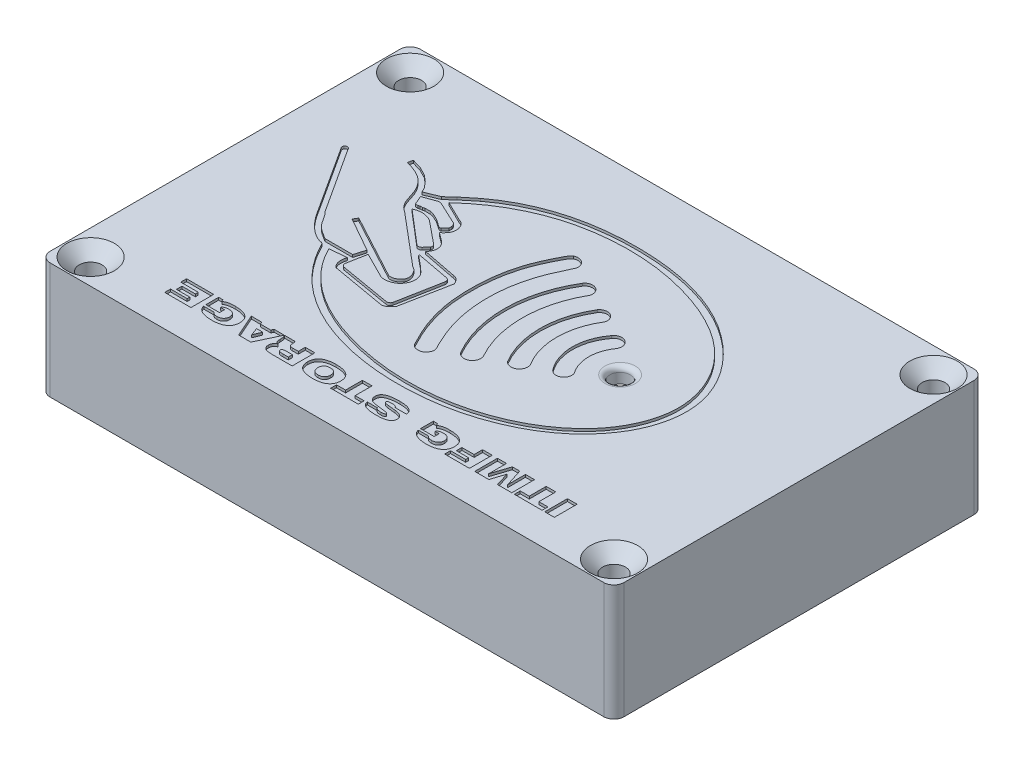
from build123d import *

# Parameters (mm, degrees)
EXTRUDE_BASE_DEPTH                     = 20
EXTRUDE_LID_DEPTH                      = 3
CUT_LED_HOLE_DEPTH                     = 3
CUT_LED_HOLE_DEPTH_BACK                = 5
LED_HOLE_R                             = 2
SMOOTH_LED_HOLE_R                      = 1
CUT_LOGO_DEPTH                         = 0.5
TEXT_2_W                               = 1.903846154
TEXT_2_H                               = 4.5
CUT_EXTRUDE1_DEPTH                     = 0.5
CUT_THE_SCREW_HOLES_NICELY_D           = 4.5
CUT_THE_SCREW_HOLES_NICELY_CSINK_D     = 9.4
CUT_THE_SCREW_HOLES_NICELY_CSINK_ANGLE = 90


with BuildPart() as part:
    # Base Outline → Extrude Base (new body)
    with BuildSketch(Plane(origin=(0, 0, 0), x_dir=(1, 0, 0), z_dir=(0, 1, 0))):
        with BuildLine():
            Line((-54.812393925, -36.63058605), (54.698066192, -36.63058605))
            ThreePointArc((54.698066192, -36.63058605), (56.112279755, -36.044799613), (56.698066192, -34.63058605))
            Line((56.698066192, -34.63058605), (56.698066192, 34.575855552))
            ThreePointArc((56.698066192, 34.575855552), (56.112279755, 35.990069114), (54.698066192, 36.575855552))
            Line((54.698066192, 36.575855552), (-54.812393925, 36.575855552))
            ThreePointArc((-54.812393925, 36.575855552), (-56.226607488, 35.990069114), (-56.812393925, 34.575855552))
            Line((-56.812393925, 34.575855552), (-56.812393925, -34.63058605))
            ThreePointArc((-56.812393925, -34.63058605), (-56.226607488, -36.044799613), (-54.812393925, -36.63058605))
        make_face()
        with BuildLine():
            Line((-44.812393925, -26.63058605), (44.727963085, -26.63058605))
            ThreePointArc((44.727963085, -26.63058605), (46.142176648, -26.044799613), (46.727963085, -24.63058605))
            Line((46.727963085, -24.63058605), (46.727963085, 24.575855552))
            ThreePointArc((46.727963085, 24.575855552), (46.142176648, 25.990069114), (44.727963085, 26.575855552))
            Line((44.727963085, 26.575855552), (-44.812393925, 26.575855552))
            ThreePointArc((-44.812393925, 26.575855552), (-46.226607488, 25.990069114), (-46.812393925, 24.575855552))
            Line((-46.812393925, 24.575855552), (-46.812393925, -24.63058605))
            ThreePointArc((-46.812393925, -24.63058605), (-46.226607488, -26.044799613), (-44.812393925, -26.63058605))
        make_face(mode=Mode.SUBTRACT)
    extrude(amount=EXTRUDE_BASE_DEPTH)

    # Lid Outline → Extrude Lid (add)
    with BuildSketch(Plane(origin=(0, 20, 0), x_dir=(1, 0, 0), z_dir=(0, 1, 0))):
        with BuildLine():
            Line((-54.812393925, 36.575855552), (54.698066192, 36.575855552))
            ThreePointArc((54.698066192, 36.575855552), (56.112279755, 35.990069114), (56.698066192, 34.575855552))
            Line((56.698066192, 34.575855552), (56.698066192, -34.63058605))
            ThreePointArc((56.698066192, -34.63058605), (56.112279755, -36.044799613), (54.698066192, -36.63058605))
            Line((54.698066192, -36.63058605), (-54.812393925, -36.63058605))
            ThreePointArc((-54.812393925, -36.63058605), (-56.226607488, -36.044799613), (-56.812393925, -34.63058605))
            Line((-56.812393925, -34.63058605), (-56.812393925, 34.575855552))
            ThreePointArc((-56.812393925, 34.575855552), (-56.226607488, 35.990069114), (-54.812393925, 36.575855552))
        make_face()
    extrude(amount=EXTRUDE_LID_DEPTH)

    # LED Hole → Cut LED Hole (cut, two sides: drawn at the far end of the back side and taken through both)
    with BuildSketch(Plane.XZ.offset(-20).offset(-CUT_LED_HOLE_DEPTH_BACK)):
        with Locations(Location((20.727963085, -0.57585555, 0), (0, 0, 90))):
            Circle(LED_HOLE_R)
    extrude(amount=CUT_LED_HOLE_DEPTH + CUT_LED_HOLE_DEPTH_BACK, mode=Mode.SUBTRACT)

    # Smooth LED Hole
    smooth_led_hole_edges = [part.edges().sort_by_distance(p)[0] for p in [
        (20.727963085, 23, -2.57585555),
    ]]
    fillet(smooth_led_hole_edges, radius=SMOOTH_LED_HOLE_R)

    # RDIF Logo → Cut logo (cut)
    # profile 1 of 5: a face of its own
    with BuildSketch(Plane(origin=(0, 23, 0), x_dir=(1, 0, 0), z_dir=(0, 1, 0))):
        with BuildLine():
            Line((-36.453230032, 16.864000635), (-34.55383018, 16.300568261))
            Line((-34.55383018, 16.300568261), (-32.880662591, 15.44980508))
            Line((-32.880662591, 15.44980508), (-31.60451782, 14.372171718))
            Line((-31.60451782, 14.372171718), (-30.583602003, 13.12438572))
            Line((-30.583602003, 13.12438572), (-30.186579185, 12.301981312))
            Line((-30.186579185, 12.301981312), (-27.435778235, 13.436332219))
            Line((-27.435778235, 13.436332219), (-25.832494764, 14.910988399))
            Line((-25.832494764, 14.910988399), (-23.278074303, 17.000968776))
            add(Edge.make_bspline(
                [(-23.278074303, 17.000968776), (-16.047440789, 22.482347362), (0.265225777, 25.862315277), (22.80013356, 20.949843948), (34.323290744, 7.09897488), (33.293264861, -5.28073079), (27.301593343, -14.707004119), (14.921661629, -21.590516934), (-7.111487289, -24.816101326), (-25.390652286, -18.14910844), (-31.110912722, -6.646615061)],
                knots=[0, 0, 0, 0, 0.175847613, 0.320221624, 0.444344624, 0.487297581, 0.560216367, 0.656670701, 0.759438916, 1, 1, 1, 1], degree=3))
            add(Edge.make_bspline(
                [(-31.110912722, -6.646615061), (-31.318039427, -6.195488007), (-31.810513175, -6.259735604)],
                knots=[0, 0, 0, 1, 1, 1], degree=2))
            add(Edge.make_bspline(
                [(-31.810513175, -6.259735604), (-34.299918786, -5.397679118), (-36.117283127, -3.117275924), (-37.431458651, -0.954942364)],
                knots=[0, 0, 0, 0, 1, 1, 1, 1], degree=3))
            Line((-37.431458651, -0.954942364), (-45.669838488, 11.766909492))
            ThreePointArc((-45.669838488, 11.766909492), (-45.610257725, 12.607259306), (-44.825055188, 12.301981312))
            Line((-44.825055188, 12.301981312), (-36.453230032, -0.589827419))
            add(Edge.make_bspline(
                [(-36.453230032, -0.589827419), (-35.536889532, -1.444721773), (-34.701822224, -3.718891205), (-32.595818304, -4.743055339), (-31.810513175, -5.2804215)],
                knots=[0, 0, 0, 0, 0.566610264, 1, 1, 1, 1], degree=3))
            Line((-31.810513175, -5.2804215), (-26.3173643, -5.2804215))
            Line((-26.3173643, -5.2804215), (-25.669741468, -3.097205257))
            Line((-25.669741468, -3.097205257), (-32.450573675, 0.740477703))
            Line((-32.450573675, 0.740477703), (-31.974932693, 1.580891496))
            Line((-31.974932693, 1.580891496), (-19.219743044, -5.2804215))
            add(Edge.make_bspline(
                [(-19.219743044, -5.2804215), (-18.696820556, -5.461714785), (-17.784528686, -5.196225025), (-16.212112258, -3.660119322), (-17.459848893, -1.717148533), (-18.303539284, -1.408783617)],
                knots=[0, 0, 0, 0, 0.25554422, 0.468479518, 1, 1, 1, 1], degree=3))
            Line((-18.303539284, -1.408783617), (-28.528373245, 7.203531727))
            add(Edge.make_bspline(
                [(-36.702261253, 15.897255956), (-35.45959387, 15.572830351), (-33.066201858, 14.814458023), (-30.435041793, 11.287723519), (-30.365637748, 8.296754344), (-28.528373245, 7.203531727)],
                knots=[0, 0, 0, 0, 0.313403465, 0.576875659, 1, 1, 1, 1], degree=3))
            Line((-36.702261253, 15.897255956), (-36.453230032, 16.864000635))
        make_face()
        with BuildLine():
            Line((-29.650954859, -6.646615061), (-26.3173643, -6.324600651))
            add(Edge.make_bspline(
                [(-26.3173643, -6.324600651), (-26.628454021, -7.293227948), (-26.627540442, -8.488166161), (-25.669741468, -9.184966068)],
                knots=[0, 0, 0, 0, 1, 1, 1, 1], degree=3))
            Line((-25.669741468, -9.184966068), (-14.911665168, -11.068003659))
            add(Edge.make_bspline(
                [(-13.093136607, -9.773851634), (-13.542803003, -10.382088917), (-14.028171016, -11.05452876), (-14.911665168, -11.068003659)],
                knots=[0, 0, 0, 0, 1, 1, 1, 1], degree=3))
            Line((-13.093136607, -9.773851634), (-11.249053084, -0.261514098))
            add(Edge.make_bspline(
                [(-12.833707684, 1.137104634), (-12.054831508, 1.107840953), (-11.483194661, 0.42025389), (-11.249053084, -0.261514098)],
                knots=[0, 0, 0, 0, 1, 1, 1, 1], degree=3))
            Line((-12.833707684, 1.137104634), (-19.632398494, 2.464071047))
            add(Edge.make_bspline(
                [(-19.890380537, 5.845916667), (-19.413492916, 5.520192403), (-18.597391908, 4.338016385), (-19.134772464, 2.957861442), (-19.632398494, 2.464071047)],
                knots=[0, 0, 0, 0, 0.454204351, 1, 1, 1, 1], degree=3))
            Line((-19.890380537, 5.845916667), (-21.495914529, 7.05147954))
            add(Edge.make_bspline(
                [(-21.733873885, 11.209896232), (-20.978357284, 11.039809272), (-20.265799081, 10.080918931), (-20.192567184, 8.281794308), (-20.992320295, 7.451772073), (-21.495914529, 7.05147954)],
                knots=[0, 0, 0, 0, 0.422833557, 0.606809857, 1, 1, 1, 1], degree=3))
            Line((-21.733873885, 11.209896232), (-25.669741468, 13.12438572))
            add(Edge.make_bspline(
                [(-25.669741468, 13.12438572), (-22.024273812, 16.539992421), (-14.649369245, 20.937554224), (-1.356383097, 23.4439105), (13.610395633, 21.982734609), (28.39074434, 14.520341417), (33.477301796, 0.79455332), (29.782257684, -9.377896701), (20.256060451, -17.98866387), (6.503882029, -22.227968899), (-12.734108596, -20.998017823), (-25.762831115, -14.697153), (-29.650954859, -6.646615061)],
                knots=[0, 0, 0, 0, 0.101435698, 0.16877412, 0.271066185, 0.404844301, 0.476585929, 0.547212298, 0.609656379, 0.732259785, 0.825504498, 1, 1, 1, 1], degree=3))
        make_face(mode=Mode.SUBTRACT)
        Polygon((-29.548876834, 11.373389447), (-26.952651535, 12.301981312), (-26.470717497, 12.301981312), (-21.817966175, 10.114142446), (-21.495914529, 9.818763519), (-21.33391542, 9.365834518), (-21.33391542, 8.823802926), (-21.733873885, 8.387728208), (-22.13153491, 7.954158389), (-22.475328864, 7.954158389), (-24.144341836, 9.094818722), (-25.301566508, 9.638974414), (-26.064479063, 9.818763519), (-27.139206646, 9.818763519), (-27.484485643, 9.695267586), (-27.947612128, 9.695267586), (-28.250764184, 9.586839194), (-28.787110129, 9.586839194), align=None, mode=Mode.SUBTRACT)
        with BuildLine():
            Line((-28.250764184, 8.387728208), (-21.733873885, 2.833436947))
            ThreePointArc((-21.733873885, 2.833436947), (-21.217144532, 2.617011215), (-20.700415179, 2.833436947))
            Line((-20.700415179, 2.833436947), (-19.890380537, 3.73333579))
            ThreePointArc((-19.890380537, 3.73333579), (-19.918888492, 4.275334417), (-20.29344305, 4.668124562))
            Line((-20.29344305, 4.668124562), (-24.545489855, 8.131452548))
            add(Edge.make_bspline(
                [(-28.250764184, 8.387728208), (-27.108478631, 9.009359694), (-25.610444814, 8.846516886), (-24.545489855, 8.131452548)],
                knots=[0, 0, 0, 0, 1, 1, 1, 1], degree=3))
        make_face(mode=Mode.SUBTRACT)
        with BuildLine():
            Line((-19.667047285, 1.268303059), (-13.067469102, 0.022295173))
            ThreePointArc((-13.067469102, 0.022295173), (-12.61912421, -0.271000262), (-12.509487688, -0.795419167))
            Line((-12.509487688, -0.795419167), (-14.143639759, -9.450833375))
            ThreePointArc((-14.143639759, -9.450833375), (-14.431779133, -9.895626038), (-14.94902882, -10.011027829))
            Line((-14.94902882, -10.011027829), (-24.967224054, -8.304583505))
            ThreePointArc((-24.967224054, -8.304583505), (-25.424341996, -8.014231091), (-25.537530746, -7.484656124))
            Line((-25.537530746, -7.484656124), (-24.823761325, -3.704120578))
            Line((-24.823761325, -3.704120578), (-19.632398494, -6.324600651))
            add(Edge.make_bspline(
                [(-19.667047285, 1.268303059), (-19.704123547, 1.119193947), (-19.510541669, 0.991178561), (-19.16416982, 0.696089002), (-18.413582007, 0.107241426), (-17.280987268, -0.852305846), (-16.029381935, -1.983083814), (-15.592813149, -3.80275197), (-16.617653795, -6.065741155), (-18.638252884, -6.562819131), (-19.632398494, -6.324600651)],
                knots=[0, 0, 0, 0, 0.033060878, 0.052211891, 0.119094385, 0.274788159, 0.438452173, 0.533718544, 0.737249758, 1, 1, 1, 1], degree=3))
        make_face(mode=Mode.SUBTRACT)
    # profile 2 of 5: a face of its own
    with BuildSketch(Plane(origin=(0, 23, 0), x_dir=(1, 0, 0), z_dir=(0, 1, 0))):
        with BuildLine():
            ThreePointArc((-4.225157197, 16.300568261), (-2.522120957, 16.166954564), (-1.863395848, 14.590799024))
            add(Edge.make_bspline(
                [(-4.225157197, 16.300568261), (-4.641296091, 15.979485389), (-5.048363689, 15.304453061), (-5.951083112, 13.517917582), (-7.359487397, 10.548943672), (-8.534285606, 6.119180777), (-8.958858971, 0.79391961), (-8.660034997, -4.736358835), (-7.123587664, -9.958269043), (-5.549730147, -13.151813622), (-4.633979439, -14.897213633), (-3.736258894, -15.240641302), (-2.446429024, -15.150807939), (-1.741979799, -13.950104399), (-1.930421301, -13.075203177), (-2.258063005, -12.56570705), (-2.720081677, -11.575454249), (-3.60908864, -9.619618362), (-4.991102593, -5.840609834), (-6.06249277, 1.44818103), (-4.969260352, 7.678861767), (-3.225391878, 11.598934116), (-2.716841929, 12.727380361), (-2.177041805, 13.813300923), (-1.863395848, 14.590799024)],
                knots=[0, 0, 0, 0, 0.023455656, 0.035575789, 0.091466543, 0.17305309, 0.242956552, 0.33462833, 0.424685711, 0.487210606, 0.500729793, 0.510695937, 0.52922901, 0.555717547, 0.559790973, 0.569747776, 0.582937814, 0.609770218, 0.667724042, 0.765952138, 0.943514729, 0.944708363, 0.961751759, 1, 1, 1, 1], degree=3))
        make_face()
    # profile 3 of 5: a face of its own
    with BuildSketch(Plane(origin=(0, 23, 0), x_dir=(1, 0, 0), z_dir=(0, 1, 0))):
        with BuildLine():
            ThreePointArc((1.335958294, 12.565783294), (3.307638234, 13.076763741), (4.12219577, 11.209916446))
            ThreePointArc((4.12219577, 11.209916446), (1.303411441, 0.811966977), (3.950883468, -9.630915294))
            ThreePointArc((3.950883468, -9.630915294), (3.316807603, -11.868715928), (1.073401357, -11.254767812))
            ThreePointArc((1.073401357, -11.254767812), (-2.051769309, 0.691401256), (1.335958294, 12.565783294))
        make_face()
    # profile 4 of 5: a face of its own
    with BuildSketch(Plane(origin=(0, 23, 0), x_dir=(1, 0, 0), z_dir=(0, 1, 0))):
        with BuildLine():
            ThreePointArc((7.323215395, 9.460258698), (9.300679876, 9.992136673), (10.155732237, 8.131452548))
            ThreePointArc((10.155732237, 8.131452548), (8.015463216, 0.742418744), (10.155732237, -6.646615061))
            ThreePointArc((10.155732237, -6.646615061), (9.445606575, -8.662978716), (7.338107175, -8.304583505))
            ThreePointArc((7.338107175, -8.304583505), (4.859518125, 0.575766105), (7.323215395, 9.460258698))
        make_face()
    # profile 5 of 5: a face of its own
    with BuildSketch(Plane(origin=(0, 23, 0), x_dir=(1, 0, 0), z_dir=(0, 1, 0))):
        with BuildLine():
            ThreePointArc((13.16591922, 6.435321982), (15.339589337, 6.898902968), (15.89447955, 4.746730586))
            ThreePointArc((15.89447955, 4.746730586), (14.537367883, 0.555986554), (15.89447955, -3.634757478))
            ThreePointArc((15.89447955, -3.634757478), (15.335271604, -5.604386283), (13.306247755, -5.33013571))
            ThreePointArc((13.306247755, -5.33013571), (11.208633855, 0.528411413), (13.16591922, 6.435321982))
        make_face()
    extrude(amount=-CUT_LOGO_DEPTH, mode=Mode.SUBTRACT)

    # Text 2 → Cut-Extrude1 (cut)
    # profile 1 of 12: a face of its own
    with BuildSketch(Plane(origin=(0, 23, 0), x_dir=(1, 0, 0), z_dir=(0, 1, 0))):
        with Locations((37.694925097, -28.105742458)):
            Rectangle(TEXT_2_W, TEXT_2_H)
    # profile 2 of 12: a face of its own
    with BuildSketch(Plane(origin=(0, 23, 0), x_dir=(1, 0, 0), z_dir=(0, 1, 0))):
        Polygon((34.435309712, -25.855742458), (34.435309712, -29.201896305), (36.223771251, -29.201896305), (36.223771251, -30.355742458), (30.74300202, -30.355742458), (30.74300202, -29.201896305), (32.531463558, -29.201896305), (32.531463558, -25.855742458), align=None)
    # profile 3 of 12: a face of its own
    with BuildSketch(Plane(origin=(0, 23, 0), x_dir=(1, 0, 0), z_dir=(0, 1, 0))):
        Polygon((30.223771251, -25.855742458), (30.223771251, -30.355742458), (27.388735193, -30.355742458), (26.572028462, -27.614456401), (25.688615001, -30.355742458), (22.896848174, -30.355742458), (22.896848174, -25.855742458), (24.685309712, -25.855742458), (24.685309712, -29.369564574), (25.836451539, -25.855742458), (27.29768952, -25.855742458), (28.435309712, -29.369564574), (28.435309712, -25.855742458), align=None)
    # profile 4 of 12: a face of its own
    with BuildSketch(Plane(origin=(0, 23, 0), x_dir=(1, 0, 0), z_dir=(0, 1, 0))):
        Polygon((21.858386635, -25.855742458), (21.858386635, -30.355742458), (16.954540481, -30.355742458), (16.954540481, -29.201896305), (19.954540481, -29.201896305), (19.954540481, -28.624973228), (17.531463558, -28.624973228), (17.531463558, -27.528819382), (19.954540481, -27.528819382), (19.954540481, -25.855742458), align=None)
    # profile 5 of 12: a face of its own
    with BuildSketch(Plane(origin=(0, 23, 0), x_dir=(1, 0, 0), z_dir=(0, 1, 0))):
        with BuildLine():
            add(Edge.make_bspline(
                [(11.238494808, -26.273110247), (11.266769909, -26.250519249), (11.323766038, -26.204980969), (11.415117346, -26.142550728), (11.513232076, -26.08604749), (11.616167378, -26.03280738), (11.72544974, -25.985168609), (11.839697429, -25.940519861), (11.960652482, -25.902276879), (12.087626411, -25.867970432), (12.221341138, -25.837085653), (12.362742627, -25.811206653), (12.512233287, -25.78969831), (12.669475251, -25.771952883), (12.835056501, -25.757174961), (13.008545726, -25.747897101), (13.190062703, -25.741057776), (13.313607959, -25.740594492), (13.376715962, -25.740357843)],
                knots=[0, 0, 0, 0, 0.772959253, 1.558108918, 2.360671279, 3.190319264, 4.032364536, 4.906130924, 5.809458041, 6.740612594, 7.715349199, 8.740157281, 9.810413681, 10.941025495, 12.120157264, 13.361006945, 14.651979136, 16, 16, 16, 16], degree=3))
            add(Edge.make_bspline(
                [(13.376715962, -25.740357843), (13.443725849, -25.741031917), (13.575370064, -25.742356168), (13.769887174, -25.748204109), (13.958015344, -25.760295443), (14.13998916, -25.77582589), (14.315370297, -25.798291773), (14.484844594, -25.82265255), (14.64800834, -25.853644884), (14.804995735, -25.888627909), (14.955671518, -25.928245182), (15.100036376, -25.972392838), (15.23854295, -26.021016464), (15.370604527, -26.07489208), (15.496352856, -26.133593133), (15.615650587, -26.197013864), (15.729210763, -26.264043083), (15.835957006, -26.336857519), (15.936966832, -26.412963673), (16.031316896, -26.494491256), (16.118389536, -26.581137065), (16.199960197, -26.671459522), (16.275095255, -26.766008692), (16.342522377, -26.86598862), (16.405241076, -26.969275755), (16.459942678, -27.078051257), (16.50913507, -27.190675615), (16.5497713, -27.308292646), (16.586898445, -27.429415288), (16.614757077, -27.555910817), (16.638838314, -27.686562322), (16.654785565, -27.821753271), (16.663630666, -27.961391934), (16.665253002, -28.055850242), (16.666078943, -28.103939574)],
                knots=[0, 0, 0, 0, 1.397529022, 2.745514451, 4.057718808, 5.328542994, 6.553487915, 7.744561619, 8.898613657, 10.016016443, 11.098214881, 12.146799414, 13.163518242, 14.158452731, 15.120010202, 16.056283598, 16.975136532, 17.868485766, 18.749552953, 19.611402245, 20.466596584, 21.309651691, 22.148363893, 22.982639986, 23.823035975, 24.666580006, 25.519843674, 26.383968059, 27.260275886, 28.160194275, 29.083310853, 30.030011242, 30.997066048, 32, 32, 32, 32], degree=3))
            add(Edge.make_bspline(
                [(16.666078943, -28.103939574), (16.665231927, -28.152025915), (16.663562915, -28.246778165), (16.65498001, -28.386758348), (16.638285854, -28.522359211), (16.616527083, -28.653781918), (16.585965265, -28.780156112), (16.551561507, -28.902464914), (16.508553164, -29.01946188), (16.460941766, -29.132975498), (16.406279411, -29.241982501), (16.343511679, -29.34556293), (16.275620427, -29.445251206), (16.202110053, -29.541119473), (16.12043459, -29.631221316), (16.032551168, -29.716979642), (15.93918738, -29.799212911), (15.83855603, -29.875802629), (15.732025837, -29.948029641), (15.61912975, -30.015665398), (15.499913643, -30.078704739), (15.374642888, -30.137511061), (15.242865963, -30.190313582), (15.105045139, -30.239018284), (14.961654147, -30.284497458), (14.810867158, -30.322642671), (14.654619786, -30.357807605), (14.49176954, -30.388915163), (14.322580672, -30.4131865), (14.147496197, -30.435604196), (13.96613019, -30.451197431), (13.778602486, -30.463305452), (13.584684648, -30.469114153), (13.453341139, -30.47044907), (13.386631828, -30.471127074)],
                knots=[0, 0, 0, 0, 1.003941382, 1.978227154, 2.925878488, 3.855017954, 4.757258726, 5.638697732, 6.505802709, 7.357455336, 8.207443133, 9.048683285, 9.883797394, 10.724429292, 11.568331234, 12.419983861, 13.286816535, 14.163780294, 15.058026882, 15.972418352, 16.90963222, 17.872155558, 18.859917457, 19.871744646, 20.92323637, 21.998867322, 23.11739252, 24.266439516, 25.458709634, 26.68488499, 27.950737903, 29.257999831, 30.607339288, 32, 32, 32, 32], degree=3))
            add(Edge.make_bspline(
                [(13.386631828, -30.471127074), (13.27541511, -30.470159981), (13.058485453, -30.468273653), (12.741809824, -30.446543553), (12.442018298, -30.414248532), (12.159264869, -30.36696793), (11.892947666, -30.308805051), (11.644210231, -30.234121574), (11.41175566, -30.148334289), (11.197415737, -30.048497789), (11.002278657, -29.937486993), (10.828762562, -29.814436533), (10.677220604, -29.680908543), (10.547955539, -29.5368116), (10.441011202, -29.38228847), (10.357555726, -29.216665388), (10.295944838, -29.040468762), (10.273546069, -28.917733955), (10.262232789, -28.855742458)],
                knots=[0, 0, 0, 0, 1.395080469, 2.721122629, 3.980449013, 5.176573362, 6.31616113, 7.397966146, 8.432194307, 9.42219203, 10.361110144, 11.24502482, 12.08623394, 12.88987641, 13.667856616, 14.436639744, 15.210370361, 16, 16, 16, 16], degree=3))
            Line((10.262232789, -28.855742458), (12.281463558, -28.855742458))
            add(Edge.make_bspline(
                [(12.281463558, -28.855742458), (12.308319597, -28.893016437), (12.361682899, -28.967080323), (12.460456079, -29.061319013), (12.570060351, -29.142323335), (12.692835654, -29.207357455), (12.828805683, -29.257036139), (12.977790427, -29.291439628), (13.139577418, -29.313572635), (13.251939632, -29.316017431), (13.310009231, -29.31728092)],
                knots=[0, 0, 0, 0, 0.934673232, 1.857207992, 2.768595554, 3.705653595, 4.678399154, 5.710837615, 6.816944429, 8, 8, 8, 8], degree=3))
            add(Edge.make_bspline(
                [(13.310009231, -29.31728092), (13.359325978, -29.316210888), (13.455501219, -29.314124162), (13.596068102, -29.298784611), (13.728983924, -29.272538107), (13.854993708, -29.236715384), (13.973570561, -29.18996355), (14.084093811, -29.131651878), (14.187330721, -29.064080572), (14.282119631, -28.986320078), (14.367902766, -28.899872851), (14.442995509, -28.805446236), (14.505313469, -28.702896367), (14.558535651, -28.594784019), (14.597665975, -28.478173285), (14.626697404, -28.355119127), (14.644106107, -28.224629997), (14.645920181, -28.135242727), (14.646848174, -28.089516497)],
                knots=[0, 0, 0, 0, 1.155920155, 2.254222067, 3.309584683, 4.328374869, 5.32112012, 6.291499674, 7.252658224, 8.208641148, 9.159941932, 10.102677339, 11.029249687, 11.968029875, 12.92138843, 13.905475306, 14.928541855, 16, 16, 16, 16], degree=3))
            add(Edge.make_bspline(
                [(14.646848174, -28.089516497), (14.645950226, -28.043484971), (14.644200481, -27.953787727), (14.626544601, -27.823416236), (14.598640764, -27.700869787), (14.560471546, -27.585871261), (14.50914498, -27.479432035), (14.447467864, -27.380624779), (14.375453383, -27.288746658), (14.290622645, -27.206860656), (14.197121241, -27.132980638), (14.09426575, -27.068194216), (13.982140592, -27.014506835), (13.861431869, -26.970109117), (13.731925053, -26.935909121), (13.593734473, -26.912336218), (13.446814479, -26.896038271), (13.345814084, -26.894827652), (13.29378327, -26.894203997)],
                knots=[0, 0, 0, 0, 1.0779236, 2.1004469, 3.075560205, 4.019476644, 4.932623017, 5.837043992, 6.7440914, 7.660082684, 8.592429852, 9.531925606, 10.501687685, 11.499509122, 12.541143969, 13.634882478, 14.781598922, 16, 16, 16, 16], degree=3))
            add(Edge.make_bspline(
                [(13.29378327, -26.894203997), (13.217375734, -26.895836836), (13.070689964, -26.89897153), (12.860614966, -26.925355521), (12.669733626, -26.967387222), (12.52571646, -27.019591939), (12.422186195, -27.067961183), (12.354420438, -27.108100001), (12.293390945, -27.150017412), (12.240672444, -27.196513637), (12.19538423, -27.245935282), (12.158074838, -27.298581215), (12.128407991, -27.354310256), (12.115073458, -27.393688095), (12.108386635, -27.413434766)],
                knots=[0, 0, 0, 0, 1.999009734, 3.837661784, 5.531697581, 7.103873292, 7.835523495, 8.519331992, 9.162934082, 9.770299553, 10.354835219, 10.913402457, 11.455107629, 12, 12, 12, 12], degree=3))
            Line((12.108386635, -27.413434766), (12.916078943, -27.413434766))
            Line((12.916078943, -27.413434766), (12.916078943, -28.394203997))
            Line((12.916078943, -28.394203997), (10.204540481, -28.394203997))
            Line((10.204540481, -28.394203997), (10.204540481, -25.855742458))
            Line((10.204540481, -25.855742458), (11.037473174, -25.855742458))
            Line((11.037473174, -25.855742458), (11.238494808, -26.273110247))
        make_face()
    # profile 6 of 12: a face of its own
    with BuildSketch(Plane(origin=(0, 23, 0), x_dir=(1, 0, 0), z_dir=(0, 1, 0))):
        with BuildLine():
            Line((6.345465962, -27.298050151), (4.044985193, -27.300754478))
            add(Edge.make_bspline(
                [(4.044985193, -27.300754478), (4.04194629, -27.284966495), (4.035819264, -27.253134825), (4.016252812, -27.208354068), (3.990609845, -27.166353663), (3.958661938, -27.126688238), (3.918487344, -27.091160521), (3.872127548, -27.057417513), (3.818515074, -27.026881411), (3.758054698, -26.99924746), (3.691547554, -26.974095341), (3.618965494, -26.952341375), (3.540513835, -26.934960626), (3.456781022, -26.918926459), (3.366885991, -26.909281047), (3.271446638, -26.899245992), (3.169711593, -26.895553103), (3.099972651, -26.894661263), (3.064215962, -26.894203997)],
                knots=[0, 0, 0, 0, 0.674427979, 1.359779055, 2.040336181, 2.741012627, 3.492500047, 4.288770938, 5.149336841, 6.082298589, 7.082189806, 8.137715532, 9.265867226, 10.460641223, 11.720923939, 13.066460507, 14.495909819, 16, 16, 16, 16], degree=3))
            add(Edge.make_bspline(
                [(3.064215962, -26.894203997), (3.028450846, -26.894182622), (2.959292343, -26.894141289), (2.859235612, -26.899311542), (2.766292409, -26.905080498), (2.680298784, -26.914185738), (2.601118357, -26.925529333), (2.52905432, -26.940249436), (2.463352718, -26.955776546), (2.405220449, -26.975996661), (2.352980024, -26.996897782), (2.308903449, -27.022438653), (2.271047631, -27.049554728), (2.240005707, -27.079568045), (2.21508826, -27.112133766), (2.197614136, -27.147962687), (2.187497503, -27.186624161), (2.186048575, -27.213255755), (2.185309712, -27.226836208)],
                knots=[0, 0, 0, 0, 1.676558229, 3.241937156, 4.69637178, 6.042147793, 7.295366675, 8.444745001, 9.490315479, 10.457079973, 11.328388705, 12.123469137, 12.839200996, 13.50672136, 14.140691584, 14.751867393, 15.36353013, 16, 16, 16, 16], degree=3))
            add(Edge.make_bspline(
                [(2.185309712, -27.226836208), (2.187401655, -27.250811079), (2.191603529, -27.298966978), (2.232679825, -27.364365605), (2.294505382, -27.420792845), (2.380336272, -27.469362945), (2.490111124, -27.509668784), (2.624676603, -27.543902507), (2.784273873, -27.573475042), (2.899745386, -27.586671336), (2.961451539, -27.593723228)],
                knots=[0, 0, 0, 0, 0.617586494, 1.240483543, 1.947713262, 2.780866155, 3.784570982, 4.979916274, 6.38611495, 8, 8, 8, 8], degree=3))
            Line((2.961451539, -27.593723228), (4.541679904, -27.751475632))
            add(Edge.make_bspline(
                [(4.541679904, -27.751475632), (4.611808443, -27.759698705), (4.747752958, -27.775639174), (4.943918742, -27.811864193), (5.127248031, -27.852223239), (5.297010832, -27.901890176), (5.45358541, -27.958766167), (5.597450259, -28.021851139), (5.726800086, -28.09481225), (5.84391096, -28.172853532), (5.947473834, -28.258483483), (6.036515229, -28.352389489), (6.112792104, -28.452358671), (6.175023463, -28.560166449), (6.2224006, -28.67490043), (6.257470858, -28.796310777), (6.276974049, -28.92482291), (6.27994837, -29.012831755), (6.281463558, -29.057665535)],
                knots=[0, 0, 0, 0, 1.406763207, 2.72701738, 3.973436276, 5.146401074, 6.248909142, 7.291643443, 8.272846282, 9.204580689, 10.093194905, 10.944548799, 11.778110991, 12.593647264, 13.417712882, 14.246010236, 15.106476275, 16, 16, 16, 16], degree=3))
            add(Edge.make_bspline(
                [(6.281463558, -29.057665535), (6.279437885, -29.117007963), (6.27548985, -29.232666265), (6.243283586, -29.399862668), (6.191025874, -29.554858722), (6.117275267, -29.697441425), (6.021334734, -29.826979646), (5.903280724, -29.942621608), (5.765790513, -30.04722425), (5.635450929, -30.122182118), (5.520430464, -30.174594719), (5.427697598, -30.214067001), (5.32770769, -30.24870918), (5.221967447, -30.282056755), (5.109787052, -30.312619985), (4.991743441, -30.340852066), (4.867026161, -30.364504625), (4.736395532, -30.387395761), (4.59929312, -30.407010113), (4.455930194, -30.424212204), (4.3064885, -30.438121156), (4.150908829, -30.451412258), (3.989157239, -30.459954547), (3.820857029, -30.465972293), (3.646578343, -30.471127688), (3.528162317, -30.471127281), (3.468062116, -30.471127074)],
                knots=[0, 0, 0, 0, 1.210317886, 2.358907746, 3.460416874, 4.538338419, 5.621341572, 6.73576545, 7.899722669, 9.138797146, 9.794531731, 10.478999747, 11.194703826, 11.95306369, 12.741545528, 13.567074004, 14.429387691, 15.331702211, 16.273536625, 17.255521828, 18.278214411, 19.336471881, 20.442002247, 21.583432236, 22.773508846, 24, 24, 24, 24], degree=3))
            add(Edge.make_bspline(
                [(3.468062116, -30.471127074), (3.405558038, -30.471129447), (3.282334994, -30.471134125), (3.10084767, -30.465938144), (2.925327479, -30.460052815), (2.756126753, -30.451025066), (2.592636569, -30.439319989), (2.435434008, -30.425075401), (2.284261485, -30.407874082), (2.139376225, -30.388155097), (2.000468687, -30.365797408), (1.868045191, -30.3402131), (1.741209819, -30.313792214), (1.621198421, -30.282754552), (1.506609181, -30.250807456), (1.398750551, -30.214142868), (1.296096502, -30.17707554), (1.170264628, -30.123530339), (1.026059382, -30.049644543), (0.87063967, -29.94826318), (0.737384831, -29.833535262), (0.625153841, -29.707307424), (0.534047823, -29.56927982), (0.464729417, -29.41928579), (0.41683297, -29.257328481), (0.403598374, -29.144207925), (0.396848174, -29.086511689)],
                knots=[0, 0, 0, 0, 1.21628474, 2.397832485, 3.532977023, 4.633852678, 5.694968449, 6.722541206, 7.705366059, 8.65555504, 9.567851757, 10.442881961, 11.280110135, 12.088498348, 12.854760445, 13.594411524, 14.304823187, 14.978195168, 16.254441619, 17.452955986, 18.580651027, 19.665980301, 20.729895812, 21.786846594, 22.871198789, 24, 24, 24, 24], degree=3))
            Line((0.396848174, -29.086511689), (2.379119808, -29.086511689))
            add(Edge.make_bspline(
                [(2.379119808, -29.086511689), (2.383458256, -29.102892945), (2.392036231, -29.13528195), (2.413307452, -29.181457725), (2.442682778, -29.224261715), (2.479823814, -29.263620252), (2.523860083, -29.299992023), (2.574666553, -29.333750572), (2.633779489, -29.362878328), (2.699585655, -29.390164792), (2.77305013, -29.413161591), (2.853399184, -29.433825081), (2.940604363, -29.451801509), (3.034777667, -29.466205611), (3.135892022, -29.476579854), (3.244083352, -29.484943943), (3.359255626, -29.489113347), (3.43831203, -29.489935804), (3.478879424, -29.490357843)],
                knots=[0, 0, 0, 0, 0.649635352, 1.284458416, 1.940310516, 2.634019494, 3.354725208, 4.128920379, 4.969761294, 5.880119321, 6.86137537, 7.92168185, 9.064074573, 10.27778784, 11.577058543, 12.965099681, 14.442656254, 16, 16, 16, 16], degree=3))
            add(Edge.make_bspline(
                [(3.478879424, -29.490357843), (3.536600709, -29.489657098), (3.645637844, -29.488333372), (3.799448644, -29.474320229), (3.933679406, -29.450258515), (4.032749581, -29.422764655), (4.100673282, -29.394916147), (4.143859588, -29.374277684), (4.179639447, -29.349938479), (4.210022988, -29.325427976), (4.232363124, -29.297511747), (4.251119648, -29.269625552), (4.259564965, -29.238101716), (4.261345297, -29.216948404), (4.262232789, -29.206403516)],
                knots=[0, 0, 0, 0, 2.319292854, 4.381209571, 6.197888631, 7.795243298, 8.499363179, 9.147405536, 9.713413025, 10.236021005, 10.707586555, 11.146645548, 11.574604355, 12, 12, 12, 12], degree=3))
            add(Edge.make_bspline(
                [(4.262232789, -29.206403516), (4.260521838, -29.186671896), (4.257107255, -29.147293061), (4.221857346, -29.094893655), (4.16934771, -29.050732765), (4.109741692, -29.023624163), (4.051045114, -29.002723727), (3.99386693, -28.988005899), (3.926502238, -28.972889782), (3.848164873, -28.957134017), (3.758714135, -28.943481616), (3.65836718, -28.928945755), (3.547531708, -28.914338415), (3.469885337, -28.906048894), (3.429300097, -28.901716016)],
                knots=[0, 0, 0, 0, 0.743110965, 1.483043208, 2.32706045, 3.335241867, 3.954133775, 4.700848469, 5.580868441, 6.584036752, 7.742923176, 9.026259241, 10.445645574, 12, 12, 12, 12], degree=3))
            Line((3.429300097, -28.901716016), (1.618302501, -28.680862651))
            add(Edge.make_bspline(
                [(1.618302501, -28.680862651), (1.559298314, -28.671238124), (1.444668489, -28.652540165), (1.279094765, -28.615450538), (1.124786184, -28.571741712), (0.98213904, -28.520239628), (0.850703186, -28.462880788), (0.731111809, -28.397954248), (0.62304806, -28.325510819), (0.526428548, -28.246137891), (0.440319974, -28.160150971), (0.367593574, -28.065606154), (0.304137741, -27.965017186), (0.25428277, -27.856173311), (0.213882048, -27.741037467), (0.186597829, -27.618479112), (0.168717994, -27.489084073), (0.166972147, -27.400276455), (0.166078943, -27.354841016)],
                knots=[0, 0, 0, 0, 1.315230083, 2.555150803, 3.731238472, 4.841773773, 5.889689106, 6.883809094, 7.831856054, 8.747821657, 9.63143165, 10.502987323, 11.367113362, 12.242647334, 13.131289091, 14.047087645, 15.000857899, 16, 16, 16, 16], degree=3))
            add(Edge.make_bspline(
                [(0.166078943, -27.354841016), (0.166400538, -27.320553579), (0.167033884, -27.253028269), (0.177941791, -27.153786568), (0.192309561, -27.057738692), (0.215753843, -26.965585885), (0.242929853, -26.876374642), (0.277798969, -26.790954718), (0.318251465, -26.708896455), (0.364942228, -26.630262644), (0.419237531, -26.555928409), (0.477992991, -26.483786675), (0.544394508, -26.416007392), (0.617029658, -26.35200559), (0.695039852, -26.290369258), (0.780517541, -26.234173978), (0.870791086, -26.179302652), (0.96829941, -26.129252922), (1.072706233, -26.082041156), (1.184228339, -26.038441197), (1.302476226, -25.996547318), (1.428106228, -25.959095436), (1.560959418, -25.923839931), (1.701019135, -25.891465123), (1.84843587, -25.862919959), (2.002544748, -25.836504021), (2.164350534, -25.814281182), (2.333272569, -25.794645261), (2.509339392, -25.777193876), (2.692428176, -25.764163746), (2.882926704, -25.752950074), (3.080705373, -25.746245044), (3.285647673, -25.741518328), (3.424489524, -25.740749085), (3.495105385, -25.740357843)],
                knots=[0, 0, 0, 0, 0.796512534, 1.568643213, 2.318464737, 3.051973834, 3.77654981, 4.484714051, 5.193773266, 5.90169636, 6.607272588, 7.331646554, 8.062657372, 8.809741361, 9.580987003, 10.371351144, 11.18588078, 12.035586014, 12.917105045, 13.848355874, 14.818100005, 15.832301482, 16.894547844, 18.012771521, 19.172982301, 20.384391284, 21.64675765, 22.968810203, 24.337244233, 25.758970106, 27.235088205, 28.772701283, 30.358575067, 32, 32, 32, 32], degree=3))
            add(Edge.make_bspline(
                [(3.495105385, -25.740357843), (3.606010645, -25.74150289), (3.821680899, -25.743729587), (4.135119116, -25.762794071), (4.42878371, -25.79386796), (4.702477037, -25.837513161), (4.956192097, -25.894345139), (5.190583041, -25.961694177), (5.404503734, -26.044222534), (5.598645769, -26.138092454), (5.771718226, -26.244359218), (5.922814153, -26.361808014), (6.051430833, -26.490521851), (6.157203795, -26.630549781), (6.240610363, -26.781521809), (6.298953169, -26.944425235), (6.337407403, -27.117503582), (6.342747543, -27.237145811), (6.345465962, -27.298050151)],
                knots=[0, 0, 0, 0, 1.473834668, 2.866070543, 4.171434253, 5.397158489, 6.547164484, 7.625068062, 8.635149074, 9.590651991, 10.487215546, 11.329210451, 12.128342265, 12.898274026, 13.654253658, 14.410992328, 15.191109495, 16, 16, 16, 16], degree=3))
        make_face()
    # profile 7 of 12: a face of its own
    with BuildSketch(Plane(origin=(0, 23, 0), x_dir=(1, 0, 0), z_dir=(0, 1, 0))):
        Polygon((-1.910844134, -25.855742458), (-1.910844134, -29.201896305), (-0.122382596, -29.201896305), (-0.122382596, -30.355742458), (-5.603151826, -30.355742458), (-5.603151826, -29.201896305), (-3.814690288, -29.201896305), (-3.814690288, -25.855742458), align=None)
    # profile 8 of 12: a face of its own
    with BuildSketch(Plane(origin=(0, 23, 0), x_dir=(1, 0, 0), z_dir=(0, 1, 0))):
        with BuildLine():
            add(Edge.make_bspline(
                [(-5.833921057, -28.103939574), (-5.834768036, -28.15202593), (-5.836436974, -28.246778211), (-5.845020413, -28.386758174), (-5.861712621, -28.522359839), (-5.883478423, -28.65377965), (-5.914015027, -28.780164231), (-5.948509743, -28.902435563), (-5.991227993, -29.019679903), (-6.040103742, -29.132800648), (-6.094783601, -29.241689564), (-6.156214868, -29.346126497), (-6.225468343, -29.444919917), (-6.298704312, -29.541182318), (-6.380523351, -29.631166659), (-6.468371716, -29.717296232), (-6.562578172, -29.798914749), (-6.663227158, -29.875814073), (-6.769920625, -29.948297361), (-6.883432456, -30.015400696), (-7.002774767, -30.078725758), (-7.128287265, -30.137697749), (-7.260751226, -30.190310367), (-7.399223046, -30.238835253), (-7.543103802, -30.284683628), (-7.694284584, -30.32247244), (-7.851059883, -30.357952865), (-8.014262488, -30.388800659), (-8.183725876, -30.413202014), (-8.35911007, -30.435656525), (-8.541083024, -30.451190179), (-8.729211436, -30.463280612), (-8.92372848, -30.469128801), (-9.055372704, -30.470453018), (-9.122382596, -30.471127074)],
                knots=[0, 0, 0, 0, 1.002197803, 1.974791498, 2.920797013, 3.848322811, 4.74899663, 5.628904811, 6.494503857, 7.347141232, 8.195652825, 9.03222754, 9.869434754, 10.708606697, 11.551043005, 12.401216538, 13.271265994, 14.1467067, 15.039400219, 15.957578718, 16.893164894, 17.854016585, 18.845871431, 19.861843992, 20.911509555, 21.991335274, 23.107917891, 24.26112286, 25.45132232, 26.675368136, 27.945259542, 29.256500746, 30.603496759, 32, 32, 32, 32], degree=3))
            add(Edge.make_bspline(
                [(-9.122382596, -30.471127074), (-9.189392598, -30.470454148), (-9.32103704, -30.469132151), (-9.515552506, -30.463267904), (-9.703387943, -30.451254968), (-9.885340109, -30.435523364), (-10.060749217, -30.413287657), (-10.230501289, -30.388789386), (-10.393706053, -30.357956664), (-10.550479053, -30.322468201), (-10.701666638, -30.284696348), (-10.845523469, -30.238790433), (-10.983817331, -30.190561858), (-11.115976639, -30.137237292), (-11.241815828, -30.078999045), (-11.36131526, -30.015362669), (-11.474850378, -29.948308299), (-11.581531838, -29.875807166), (-11.682205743, -29.798931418), (-11.776325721, -29.717237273), (-11.864343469, -29.631519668), (-11.945017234, -29.540562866), (-12.019441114, -29.445271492), (-12.088483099, -29.346072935), (-12.150001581, -29.241704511), (-12.204649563, -29.132795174), (-12.253564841, -29.019686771), (-12.296154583, -28.902413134), (-12.33111713, -28.780314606), (-12.359775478, -28.653533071), (-12.3834628, -28.522489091), (-12.399629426, -28.386736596), (-12.408358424, -28.246783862), (-12.410007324, -28.152027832), (-12.410844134, -28.103939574)],
                knots=[0, 0, 0, 0, 1.39653918, 2.743569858, 4.054844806, 5.318531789, 6.548823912, 7.739054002, 8.892288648, 10.0089, 11.088753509, 12.138446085, 13.154444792, 14.140516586, 15.107069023, 16.042679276, 16.960881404, 17.853597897, 18.729061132, 19.599132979, 20.449328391, 21.287610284, 22.13064988, 22.967878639, 23.804474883, 24.653008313, 25.50566763, 26.371288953, 27.251219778, 28.150500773, 29.07912782, 30.025157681, 30.997776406, 32, 32, 32, 32], degree=3))
            add(Edge.make_bspline(
                [(-12.410844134, -28.103939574), (-12.410017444, -28.055850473), (-12.408393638, -27.96139262), (-12.399559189, -27.821750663), (-12.383572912, -27.686571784), (-12.359632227, -27.555876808), (-12.3312874, -27.429620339), (-12.29598166, -27.307917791), (-12.253549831, -27.190909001), (-12.204886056, -27.077968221), (-12.149751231, -26.969604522), (-12.088476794, -26.865425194), (-12.019715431, -26.766299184), (-11.944761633, -26.671710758), (-11.864038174, -26.580892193), (-11.776942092, -26.494175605), (-11.681845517, -26.413567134), (-11.581587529, -26.336516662), (-11.474836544, -26.264091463), (-11.361312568, -26.197035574), (-11.241841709, -26.133323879), (-11.115768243, -26.075354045), (-10.984014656, -26.020764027), (-10.845684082, -25.972437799), (-10.701343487, -25.928232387), (-10.550660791, -25.888632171), (-10.393675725, -25.853641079), (-10.230509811, -25.82266383), (-10.060746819, -25.798206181), (-9.88534078, -25.775959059), (-9.703387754, -25.760230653), (-9.515552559, -25.748216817), (-9.321037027, -25.742352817), (-9.189392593, -25.741030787), (-9.122382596, -25.740357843)],
                knots=[0, 0, 0, 0, 1.003055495, 1.970227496, 2.917042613, 3.84027106, 4.740298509, 5.614940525, 6.481280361, 7.334647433, 8.178293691, 9.015584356, 9.853508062, 10.692321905, 11.531299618, 12.386597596, 13.25330005, 14.129489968, 15.022947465, 15.941911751, 16.878298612, 17.845653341, 18.834908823, 19.851750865, 20.900462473, 21.98279206, 23.100330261, 24.254522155, 25.445740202, 26.677053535, 27.941789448, 29.254152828, 30.602301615, 32, 32, 32, 32], degree=3))
            add(Edge.make_bspline(
                [(-9.122382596, -25.740357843), (-9.055372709, -25.741031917), (-8.923728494, -25.742356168), (-8.729211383, -25.748204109), (-8.541083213, -25.760295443), (-8.359109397, -25.775825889), (-8.183728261, -25.798291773), (-8.014253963, -25.82265255), (-7.851090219, -25.853644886), (-7.694102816, -25.888627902), (-7.543427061, -25.92824521), (-7.399062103, -25.972392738), (-7.260555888, -26.021016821), (-7.128493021, -26.074890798), (-7.00274929, -26.133597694), (-6.883435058, -26.19699745), (-6.769934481, -26.264102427), (-6.663171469, -26.336509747), (-6.562938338, -26.413583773), (-6.467755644, -26.494116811), (-6.380831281, -26.581248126), (-6.298963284, -26.671091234), (-6.225192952, -26.766652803), (-6.156221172, -26.865371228), (-6.095033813, -26.969619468), (-6.039867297, -27.077962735), (-5.991243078, -27.190915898), (-5.948682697, -27.30789535), (-5.913842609, -27.429770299), (-5.883622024, -27.555629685), (-5.861604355, -27.686702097), (-5.845090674, -27.821728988), (-5.836401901, -27.961398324), (-5.834757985, -28.055852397), (-5.833921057, -28.103939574)],
                knots=[0, 0, 0, 0, 1.397664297, 2.745780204, 4.058111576, 5.329058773, 6.554122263, 7.745311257, 8.899475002, 10.016985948, 11.099289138, 12.147975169, 13.164792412, 14.159823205, 15.12147375, 16.057837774, 16.976779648, 17.870215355, 18.746383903, 19.613065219, 20.468342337, 21.311479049, 22.146400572, 22.984303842, 23.821574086, 24.665199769, 25.518546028, 26.384864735, 27.25948542, 28.160908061, 29.08302853, 30.029820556, 30.996968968, 32, 32, 32, 32], degree=3))
        make_face()
        with BuildLine():
            add(Edge.make_bspline(
                [(-7.853151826, -28.101235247), (-7.854186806, -28.053714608), (-7.856196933, -27.961420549), (-7.871837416, -27.827250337), (-7.896685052, -27.701675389), (-7.931811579, -27.584335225), (-7.977611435, -27.47553205), (-8.034924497, -27.376157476), (-8.101165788, -27.284679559), (-8.178176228, -27.202437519), (-8.264909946, -27.129531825), (-8.360484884, -27.06552021), (-8.465464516, -27.01268477), (-8.579394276, -26.969212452), (-8.702197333, -26.935027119), (-8.834349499, -26.911055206), (-8.975414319, -26.896396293), (-9.072465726, -26.894948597), (-9.122382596, -26.894203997)],
                knots=[0, 0, 0, 0, 1.140817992, 2.215684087, 3.238737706, 4.211100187, 5.151870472, 6.066490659, 6.959802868, 7.858257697, 8.764529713, 9.67504256, 10.614040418, 11.580145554, 12.598992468, 13.670268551, 14.801739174, 16, 16, 16, 16], degree=3))
            add(Edge.make_bspline(
                [(-9.122382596, -26.894203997), (-9.172300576, -26.894944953), (-9.269354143, -26.896385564), (-9.410403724, -26.911094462), (-9.542324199, -26.934839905), (-9.664943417, -26.969588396), (-9.779091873, -27.01244188), (-9.884269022, -27.065550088), (-9.979859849, -27.129523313), (-10.066581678, -27.202442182), (-10.143623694, -27.284669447), (-10.209750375, -27.376193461), (-10.267445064, -27.475292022), (-10.311540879, -27.584738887), (-10.348462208, -27.701457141), (-10.372813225, -27.827288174), (-10.38859958, -27.961410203), (-10.390589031, -28.053711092), (-10.391613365, -28.101235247)],
                knots=[0, 0, 0, 0, 1.198327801, 2.329861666, 3.401197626, 4.413153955, 5.386052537, 6.325102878, 7.235666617, 8.141989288, 9.040494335, 9.933856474, 10.848527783, 11.786551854, 12.76108127, 13.784192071, 14.859118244, 16, 16, 16, 16], degree=3))
            add(Edge.make_bspline(
                [(-10.391613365, -28.101235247), (-10.390581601, -28.149058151), (-10.388577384, -28.241954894), (-10.37292, -28.376701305), (-10.34832034, -28.503074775), (-10.311553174, -28.620424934), (-10.267445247, -28.73075392), (-10.209772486, -28.830774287), (-10.143600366, -28.923126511), (-10.066920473, -29.006385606), (-9.979535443, -29.079083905), (-9.884609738, -29.144364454), (-9.778842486, -29.196948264), (-9.665173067, -29.24126344), (-9.542295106, -29.275725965), (-9.410351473, -29.299220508), (-9.26941721, -29.315416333), (-9.172311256, -29.316647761), (-9.122382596, -29.31728092)],
                knots=[0, 0, 0, 0, 1.14432277, 2.222864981, 3.242616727, 4.220818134, 5.162405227, 6.080321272, 6.976569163, 7.877393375, 8.780740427, 9.692323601, 10.628290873, 11.600578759, 12.609212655, 13.677031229, 14.805606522, 16, 16, 16, 16], degree=3))
            add(Edge.make_bspline(
                [(-9.122382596, -29.31728092), (-9.07245506, -29.316644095), (-8.975351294, -29.315405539), (-8.834401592, -29.299260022), (-8.702226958, -29.275538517), (-8.579161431, -29.241643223), (-8.465715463, -29.196705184), (-8.360143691, -29.144394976), (-8.265234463, -29.079075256), (-8.177837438, -29.00639028), (-8.101189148, -28.923116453), (-8.034902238, -28.830810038), (-7.977612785, -28.730515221), (-7.931796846, -28.620826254), (-7.896824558, -28.502858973), (-7.871730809, -28.37673879), (-7.856219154, -28.241944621), (-7.854194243, -28.14905466), (-7.853151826, -28.101235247)],
                knots=[0, 0, 0, 0, 1.194325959, 2.322837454, 3.390595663, 4.406096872, 5.371630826, 6.307545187, 7.219076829, 8.122372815, 9.023146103, 9.91934333, 10.837207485, 11.781511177, 12.757566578, 13.777260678, 14.855741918, 16, 16, 16, 16], degree=3))
        make_face(mode=Mode.SUBTRACT)
    # profile 9 of 12: a face of its own
    with BuildSketch(Plane(origin=(0, 23, 0), x_dir=(1, 0, 0), z_dir=(0, 1, 0))):
        with BuildLine():
            add(Edge.make_bspline(
                [(-16.955014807, -30.355742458), (-17.007600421, -30.355584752), (-17.109774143, -30.355278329), (-17.25912332, -30.352466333), (-17.400076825, -30.348231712), (-17.533157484, -30.341425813), (-17.658276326, -30.335113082), (-17.775376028, -30.324437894), (-17.884630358, -30.314457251), (-18.015868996, -30.296478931), (-18.165316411, -30.270528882), (-18.327853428, -30.231392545), (-18.470050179, -30.185330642), (-18.55367184, -30.143644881), (-18.59293548, -30.124071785)],
                knots=[0, 0, 0, 0, 1.134770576, 2.204856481, 3.223407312, 4.177679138, 5.080488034, 5.926459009, 6.714907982, 7.447633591, 8.784484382, 9.98602312, 11.054359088, 12, 12, 12, 12], degree=3))
            add(Edge.make_bspline(
                [(-18.59293548, -30.124071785), (-18.63693742, -30.098135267), (-18.723474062, -30.047127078), (-18.83905922, -29.952552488), (-18.936880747, -29.84411658), (-19.019202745, -29.724516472), (-19.082262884, -29.592246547), (-19.128293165, -29.450501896), (-19.156045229, -29.298525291), (-19.159215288, -29.194201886), (-19.160844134, -29.140598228)],
                knots=[0, 0, 0, 0, 1.023360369, 2.012596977, 2.981056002, 3.94385461, 4.914186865, 5.909006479, 6.925601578, 8, 8, 8, 8], degree=3))
            add(Edge.make_bspline(
                [(-19.160844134, -29.140598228), (-19.159993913, -29.107831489), (-19.158313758, -29.043079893), (-19.14972597, -28.947461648), (-19.133036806, -28.854764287), (-19.110718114, -28.765327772), (-19.082635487, -28.678355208), (-19.047540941, -28.594886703), (-19.005734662, -28.514235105), (-18.958242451, -28.437011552), (-18.904858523, -28.363809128), (-18.846666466, -28.295418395), (-18.782780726, -28.232659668), (-18.714471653, -28.175383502), (-18.641952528, -28.122337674), (-18.564197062, -28.075804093), (-18.481867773, -28.033660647), (-18.423977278, -28.010910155), (-18.394618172, -27.999372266)],
                knots=[0, 0, 0, 0, 1.071814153, 2.1180526, 3.135847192, 4.148744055, 5.130710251, 6.121681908, 7.106152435, 8.098827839, 9.083543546, 10.066246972, 11.032101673, 12.008446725, 12.979436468, 13.966991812, 14.968961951, 16, 16, 16, 16], degree=3))
            add(Edge.make_bspline(
                [(-18.394618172, -27.999372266), (-18.44381771, -27.978552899), (-18.536846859, -27.939186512), (-18.661266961, -27.866137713), (-18.761395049, -27.784607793), (-18.829792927, -27.70931678), (-18.86957702, -27.640138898), (-18.897160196, -27.5809697), (-18.919632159, -27.512334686), (-18.940574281, -27.435711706), (-18.957557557, -27.350457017), (-18.97057304, -27.256500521), (-18.981741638, -27.153715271), (-18.985705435, -27.082031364), (-18.987767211, -27.044744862)],
                knots=[0, 0, 0, 0, 1.57797581, 2.983722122, 4.245892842, 5.385416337, 5.96265548, 6.598409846, 7.311738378, 8.093735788, 8.945394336, 9.878533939, 10.896515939, 12, 12, 12, 12], degree=3))
            add(Edge.make_bspline(
                [(-18.987767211, -27.044744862), (-18.988667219, -27.024312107), (-18.990758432, -26.976835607), (-18.992872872, -26.929360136), (-18.994077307, -26.902316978)],
                knots=[0, 0, 0, 0, 0.860752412, 2, 2, 2, 2], degree=3))
            add(Edge.make_bspline(
                [(-18.994077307, -26.902316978), (-18.997846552, -26.833177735), (-19.004950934, -26.702862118), (-19.021534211, -26.519638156), (-19.043748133, -26.360743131), (-19.070096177, -26.226054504), (-19.100721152, -26.115067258), (-19.135932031, -26.028819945), (-19.175148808, -25.963087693), (-19.211344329, -25.937508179), (-19.227550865, -25.926054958)],
                knots=[0, 0, 0, 0, 1.616717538, 3.047235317, 4.294485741, 5.36088206, 6.251389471, 6.974604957, 7.540879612, 8, 8, 8, 8], degree=3))
            Line((-19.227550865, -25.926054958), (-19.227550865, -25.855742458))
            Line((-19.227550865, -25.855742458), (-17.192995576, -25.855742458))
            add(Edge.make_bspline(
                [(-17.192995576, -25.855742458), (-17.179282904, -25.868831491), (-17.151183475, -25.895652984), (-17.117194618, -25.945720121), (-17.087461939, -26.003348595), (-17.060983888, -26.068881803), (-17.042084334, -26.143964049), (-17.025796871, -26.226660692), (-17.013916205, -26.317889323), (-17.010748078, -26.381548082), (-17.009101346, -26.414636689)],
                knots=[0, 0, 0, 0, 0.752226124, 1.541430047, 2.391462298, 3.330295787, 4.345032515, 5.465478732, 6.682604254, 8, 8, 8, 8], degree=3))
            add(Edge.make_bspline(
                [(-17.009101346, -26.414636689), (-17.006932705, -26.452816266), (-17.002864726, -26.524434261), (-16.993658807, -26.624804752), (-16.983833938, -26.711631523), (-16.9733554, -26.764446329), (-16.968536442, -26.788735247)],
                knots=[0, 0, 0, 0, 1.218228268, 2.285176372, 3.211372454, 4, 4, 4, 4], degree=3))
            add(Edge.make_bspline(
                [(-16.968536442, -26.788735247), (-16.96258462, -26.827579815), (-16.951370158, -26.900771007), (-16.911632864, -26.99944676), (-16.857913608, -27.080653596), (-16.799002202, -27.133431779), (-16.743070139, -27.164149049), (-16.694972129, -27.185294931), (-16.639974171, -27.20153037), (-16.579033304, -27.216527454), (-16.511403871, -27.226601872), (-16.437469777, -27.23500803), (-16.357103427, -27.239136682), (-16.301472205, -27.239940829), (-16.27262298, -27.240357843)],
                knots=[0, 0, 0, 0, 1.506034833, 2.837680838, 4.051563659, 5.221534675, 5.831708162, 6.498881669, 7.236670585, 8.032122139, 8.909215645, 9.861813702, 10.891179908, 12, 12, 12, 12], degree=3))
            Line((-16.27262298, -27.240357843), (-15.122382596, -27.240357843))
            Line((-15.122382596, -27.240357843), (-15.122382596, -25.855742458))
            Line((-15.122382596, -25.855742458), (-13.218536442, -25.855742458))
            Line((-13.218536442, -25.855742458), (-13.218536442, -30.355742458))
            Line((-13.218536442, -30.355742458), (-16.955014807, -30.355742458))
        make_face()
        with BuildLine():
            Line((-15.122382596, -28.394203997), (-16.245579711, -28.394203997))
            add(Edge.make_bspline(
                [(-16.245579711, -28.394203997), (-16.285247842, -28.39458539), (-16.361305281, -28.395316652), (-16.471028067, -28.399868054), (-16.571450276, -28.406898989), (-16.663260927, -28.416482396), (-16.745705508, -28.429856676), (-16.81916076, -28.446031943), (-16.883677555, -28.464406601), (-16.93912576, -28.48713052), (-16.987386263, -28.512779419), (-17.029207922, -28.542161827), (-17.063829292, -28.576978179), (-17.091916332, -28.615472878), (-17.115410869, -28.657149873), (-17.129850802, -28.703900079), (-17.140778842, -28.753975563), (-17.1413289, -28.788968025), (-17.141613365, -28.807064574)],
                knots=[0, 0, 0, 0, 1.721402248, 3.30051969, 4.764656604, 6.089426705, 7.304894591, 8.38685299, 9.352299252, 10.211913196, 10.982012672, 11.720210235, 12.42095068, 13.101628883, 13.784302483, 14.485285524, 15.216656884, 16, 16, 16, 16], degree=3))
            add(Edge.make_bspline(
                [(-17.141613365, -28.807064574), (-17.141236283, -28.824842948), (-17.140508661, -28.859148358), (-17.130891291, -28.908436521), (-17.1169469, -28.953928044), (-17.095985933, -28.995182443), (-17.068243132, -29.031462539), (-17.035776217, -29.064297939), (-16.996944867, -29.092415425), (-16.951934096, -29.117675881), (-16.896810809, -29.136834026), (-16.831971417, -29.155268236), (-16.754822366, -29.168533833), (-16.66657439, -29.181794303), (-16.565964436, -29.189746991), (-16.453923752, -29.197577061), (-16.330025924, -29.200409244), (-16.243775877, -29.201385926), (-16.198704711, -29.201896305)],
                knots=[0, 0, 0, 0, 0.742485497, 1.432710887, 2.092514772, 2.727678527, 3.35609168, 3.99596317, 4.652045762, 5.355194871, 6.14659635, 7.085774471, 8.172838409, 9.417032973, 10.817760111, 12.392007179, 14.114592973, 16, 16, 16, 16], degree=3))
            Line((-16.198704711, -29.201896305), (-15.122382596, -29.201896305))
            Line((-15.122382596, -29.201896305), (-15.122382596, -28.394203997))
        make_face(mode=Mode.SUBTRACT)
    # profile 10 of 12: a face of its own
    with BuildSketch(Plane(origin=(0, 23, 0), x_dir=(1, 0, 0), z_dir=(0, 1, 0))):
        Polygon((-19.276228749, -25.855742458), (-21.386505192, -30.355742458), (-23.805074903, -30.355742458), (-25.795459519, -25.855742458), (-23.728452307, -25.855742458), (-23.566192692, -26.31728092), (-21.473043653, -26.31728092), (-21.296360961, -25.855742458), align=None)
        Polygon((-21.921961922, -27.471127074), (-23.143416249, -27.471127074), (-22.551168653, -29.018903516), align=None, mode=Mode.SUBTRACT)
    # profile 11 of 12: a face of its own
    with BuildSketch(Plane(origin=(0, 23, 0), x_dir=(1, 0, 0), z_dir=(0, 1, 0))):
        with BuildLine():
            add(Edge.make_bspline(
                [(-31.223043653, -26.273110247), (-31.194768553, -26.250519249), (-31.137772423, -26.204980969), (-31.046421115, -26.142550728), (-30.948306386, -26.08604749), (-30.845371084, -26.03280738), (-30.736088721, -25.985168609), (-30.621841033, -25.940519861), (-30.50088598, -25.902276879), (-30.373912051, -25.867970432), (-30.240197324, -25.837085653), (-30.098795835, -25.811206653), (-29.949305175, -25.78969831), (-29.79206321, -25.771952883), (-29.62648196, -25.757174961), (-29.452992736, -25.747897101), (-29.271475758, -25.741057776), (-29.147930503, -25.740594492), (-29.084822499, -25.740357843)],
                knots=[0, 0, 0, 0, 0.772959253, 1.558108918, 2.360671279, 3.190319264, 4.032364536, 4.906130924, 5.809458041, 6.740612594, 7.715349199, 8.740157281, 9.810413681, 10.941025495, 12.120157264, 13.361006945, 14.651979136, 16, 16, 16, 16], degree=3))
            add(Edge.make_bspline(
                [(-29.084822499, -25.740357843), (-29.017812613, -25.741031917), (-28.886168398, -25.742356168), (-28.691651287, -25.748204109), (-28.503523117, -25.760295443), (-28.321549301, -25.77582589), (-28.146168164, -25.798291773), (-27.976693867, -25.82265255), (-27.813530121, -25.853644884), (-27.656542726, -25.888627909), (-27.505866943, -25.928245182), (-27.361502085, -25.972392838), (-27.222995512, -26.021016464), (-27.090933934, -26.07489208), (-26.965185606, -26.133593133), (-26.845887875, -26.197013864), (-26.732327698, -26.264043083), (-26.625581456, -26.336857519), (-26.524571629, -26.412963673), (-26.430221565, -26.494491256), (-26.343148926, -26.581137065), (-26.261578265, -26.671459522), (-26.186443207, -26.766008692), (-26.119016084, -26.86598862), (-26.056297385, -26.969275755), (-26.001595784, -27.078051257), (-25.952403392, -27.190675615), (-25.911767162, -27.308292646), (-25.874640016, -27.429415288), (-25.846781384, -27.555910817), (-25.822700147, -27.686562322), (-25.806752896, -27.821753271), (-25.797907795, -27.961391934), (-25.79628546, -28.055850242), (-25.795459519, -28.103939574)],
                knots=[0, 0, 0, 0, 1.397529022, 2.745514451, 4.057718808, 5.328542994, 6.553487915, 7.744561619, 8.898613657, 10.016016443, 11.098214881, 12.146799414, 13.163518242, 14.158452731, 15.120010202, 16.056283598, 16.975136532, 17.868485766, 18.749552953, 19.611402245, 20.466596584, 21.309651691, 22.148363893, 22.982639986, 23.823035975, 24.666580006, 25.519843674, 26.383968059, 27.260275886, 28.160194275, 29.083310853, 30.030011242, 30.997066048, 32, 32, 32, 32], degree=3))
            add(Edge.make_bspline(
                [(-25.795459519, -28.103939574), (-25.796306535, -28.152025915), (-25.797975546, -28.246778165), (-25.806558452, -28.386758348), (-25.823252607, -28.522359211), (-25.845011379, -28.653781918), (-25.875573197, -28.780156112), (-25.909976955, -28.902464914), (-25.952985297, -29.01946188), (-26.000596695, -29.132975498), (-26.055259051, -29.241982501), (-26.118026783, -29.34556293), (-26.185918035, -29.445251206), (-26.259428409, -29.541119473), (-26.341103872, -29.631221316), (-26.428987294, -29.716979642), (-26.522351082, -29.799212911), (-26.622982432, -29.875802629), (-26.729512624, -29.948029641), (-26.842408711, -30.015665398), (-26.961624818, -30.078704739), (-27.086895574, -30.137511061), (-27.218672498, -30.190313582), (-27.356493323, -30.239018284), (-27.499884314, -30.284497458), (-27.650671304, -30.322642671), (-27.806918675, -30.357807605), (-27.969768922, -30.388915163), (-28.138957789, -30.4131865), (-28.314042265, -30.435604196), (-28.495408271, -30.451197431), (-28.682935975, -30.463305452), (-28.876853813, -30.469114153), (-29.008197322, -30.47044907), (-29.074906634, -30.471127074)],
                knots=[0, 0, 0, 0, 1.003941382, 1.978227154, 2.925878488, 3.855017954, 4.757258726, 5.638697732, 6.505802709, 7.357455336, 8.207443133, 9.048683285, 9.883797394, 10.724429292, 11.568331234, 12.419983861, 13.286816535, 14.163780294, 15.058026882, 15.972418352, 16.90963222, 17.872155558, 18.859917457, 19.871744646, 20.92323637, 21.998867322, 23.11739252, 24.266439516, 25.458709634, 26.68488499, 27.950737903, 29.257999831, 30.607339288, 32, 32, 32, 32], degree=3))
            add(Edge.make_bspline(
                [(-29.074906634, -30.471127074), (-29.186123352, -30.470159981), (-29.403053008, -30.468273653), (-29.719728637, -30.446543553), (-30.019520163, -30.414248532), (-30.302273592, -30.36696793), (-30.568590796, -30.308805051), (-30.81732823, -30.234121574), (-31.049782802, -30.148334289), (-31.264122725, -30.048497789), (-31.459259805, -29.937486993), (-31.632775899, -29.814436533), (-31.784317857, -29.680908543), (-31.913582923, -29.5368116), (-32.020527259, -29.38228847), (-32.103982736, -29.216665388), (-32.165593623, -29.040468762), (-32.187992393, -28.917733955), (-32.199305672, -28.855742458)],
                knots=[0, 0, 0, 0, 1.395080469, 2.721122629, 3.980449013, 5.176573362, 6.31616113, 7.397966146, 8.432194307, 9.42219203, 10.361110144, 11.24502482, 12.08623394, 12.88987641, 13.667856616, 14.436639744, 15.210370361, 16, 16, 16, 16], degree=3))
            Line((-32.199305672, -28.855742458), (-30.180074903, -28.855742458))
            add(Edge.make_bspline(
                [(-30.180074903, -28.855742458), (-30.153218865, -28.893016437), (-30.099855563, -28.967080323), (-30.001082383, -29.061319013), (-29.89147811, -29.142323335), (-29.768702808, -29.207357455), (-29.632732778, -29.257036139), (-29.483748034, -29.291439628), (-29.321961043, -29.313572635), (-29.20959883, -29.316017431), (-29.15152923, -29.31728092)],
                knots=[0, 0, 0, 0, 0.934673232, 1.857207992, 2.768595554, 3.705653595, 4.678399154, 5.710837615, 6.816944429, 8, 8, 8, 8], degree=3))
            add(Edge.make_bspline(
                [(-29.15152923, -29.31728092), (-29.102212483, -29.316210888), (-29.006037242, -29.314124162), (-28.86547036, -29.298784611), (-28.732554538, -29.272538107), (-28.606544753, -29.236715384), (-28.487967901, -29.18996355), (-28.377444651, -29.131651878), (-28.27420774, -29.064080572), (-28.179418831, -28.986320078), (-28.093635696, -28.899872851), (-28.018542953, -28.805446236), (-27.956224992, -28.702896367), (-27.90300281, -28.594784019), (-27.863872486, -28.478173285), (-27.834841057, -28.355119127), (-27.817432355, -28.224629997), (-27.815618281, -28.135242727), (-27.814690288, -28.089516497)],
                knots=[0, 0, 0, 0, 1.155920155, 2.254222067, 3.309584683, 4.328374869, 5.32112012, 6.291499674, 7.252658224, 8.208641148, 9.159941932, 10.102677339, 11.029249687, 11.968029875, 12.92138843, 13.905475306, 14.928541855, 16, 16, 16, 16], degree=3))
            add(Edge.make_bspline(
                [(-27.814690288, -28.089516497), (-27.815588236, -28.043484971), (-27.817337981, -27.953787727), (-27.834993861, -27.823416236), (-27.862897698, -27.700869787), (-27.901066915, -27.585871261), (-27.952393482, -27.479432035), (-28.014070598, -27.380624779), (-28.086085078, -27.288746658), (-28.170915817, -27.206860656), (-28.264417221, -27.132980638), (-28.367272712, -27.068194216), (-28.47939787, -27.014506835), (-28.600106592, -26.970109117), (-28.729613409, -26.935909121), (-28.867803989, -26.912336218), (-29.014723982, -26.896038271), (-29.115724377, -26.894827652), (-29.167755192, -26.894203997)],
                knots=[0, 0, 0, 0, 1.0779236, 2.1004469, 3.075560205, 4.019476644, 4.932623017, 5.837043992, 6.7440914, 7.660082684, 8.592429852, 9.531925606, 10.501687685, 11.499509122, 12.541143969, 13.634882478, 14.781598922, 16, 16, 16, 16], degree=3))
            add(Edge.make_bspline(
                [(-29.167755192, -26.894203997), (-29.244162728, -26.895836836), (-29.390848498, -26.89897153), (-29.600923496, -26.925355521), (-29.791804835, -26.967387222), (-29.935822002, -27.019591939), (-30.039352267, -27.067961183), (-30.107118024, -27.108100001), (-30.168147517, -27.150017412), (-30.220866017, -27.196513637), (-30.266154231, -27.245935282), (-30.303463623, -27.298581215), (-30.33313047, -27.354310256), (-30.346465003, -27.393688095), (-30.353151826, -27.413434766)],
                knots=[0, 0, 0, 0, 1.999009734, 3.837661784, 5.531697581, 7.103873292, 7.835523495, 8.519331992, 9.162934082, 9.770299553, 10.354835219, 10.913402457, 11.455107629, 12, 12, 12, 12], degree=3))
            Line((-30.353151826, -27.413434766), (-29.545459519, -27.413434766))
            Line((-29.545459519, -27.413434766), (-29.545459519, -28.394203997))
            Line((-29.545459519, -28.394203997), (-32.25699798, -28.394203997))
            Line((-32.25699798, -28.394203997), (-32.25699798, -25.855742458))
            Line((-32.25699798, -25.855742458), (-31.424065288, -25.855742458))
            Line((-31.424065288, -25.855742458), (-31.223043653, -26.273110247))
        make_face()
    # profile 12 of 12: a face of its own
    with BuildSketch(Plane(origin=(0, 23, 0), x_dir=(1, 0, 0), z_dir=(0, 1, 0))):
        Polygon((-33.237767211, -25.855742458), (-33.237767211, -30.355742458), (-38.430074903, -30.355742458), (-38.430074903, -29.201896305), (-35.141613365, -29.201896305), (-35.141613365, -28.682665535), (-37.795459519, -28.682665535), (-37.795459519, -27.586511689), (-35.141613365, -27.586511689), (-35.141613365, -27.009588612), (-38.603151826, -27.009588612), (-38.603151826, -25.855742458), align=None)
    extrude(amount=-CUT_EXTRUDE1_DEPTH, mode=Mode.SUBTRACT)

    # Cut the screw holes nicely (through all)
    with Locations(Plane(origin=(51.727963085, 23, 31.63058605), x_dir=(0, 0, 1), z_dir=(0, 1, 0))):
        with Locations((0, 0), (0, -103.54035701), (-63.206441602, -103.54035701), (-63.206441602, 0)):
            CounterSinkHole(CUT_THE_SCREW_HOLES_NICELY_D / 2, CUT_THE_SCREW_HOLES_NICELY_CSINK_D / 2, counter_sink_angle=CUT_THE_SCREW_HOLES_NICELY_CSINK_ANGLE)


solid = part.part
